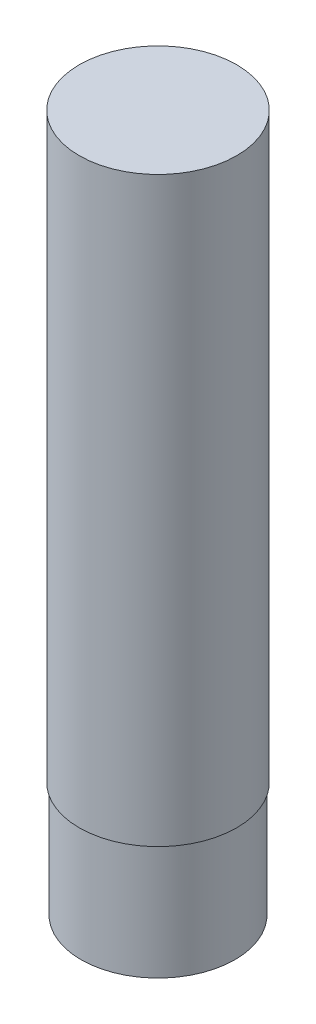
ISO-10303-21;
HEADER;
FILE_DESCRIPTION(('STEP AP214'),'2;1');
FILE_NAME('part.step','',(''),(''),'','','');
FILE_SCHEMA(('AUTOMOTIVE_DESIGN { 1 0 10303 214 1 1 1 1 }'));
ENDSEC;
DATA;
#1=APPLICATION_CONTEXT('core data for automotive mechanical design processes');
#2=APPLICATION_PROTOCOL_DEFINITION('international standard','automotive_design',2000,#1);
#3=PRODUCT_CONTEXT('',#1,'mechanical');
#4=PRODUCT('Part','Part','',(#3));
#5=PRODUCT_RELATED_PRODUCT_CATEGORY('part','',(#4));
#6=PRODUCT_DEFINITION_FORMATION('','',#4);
#7=PRODUCT_DEFINITION_CONTEXT('part definition',#1,'design');
#8=PRODUCT_DEFINITION('design','',#6,#7);
#9=PRODUCT_DEFINITION_SHAPE('','',#8);
#10=(LENGTH_UNIT() NAMED_UNIT(*) SI_UNIT(.MILLI.,.METRE.));
#11=(NAMED_UNIT(*) PLANE_ANGLE_UNIT() SI_UNIT($,.RADIAN.));
#12=(NAMED_UNIT(*) SI_UNIT($,.STERADIAN.) SOLID_ANGLE_UNIT());
#13=UNCERTAINTY_MEASURE_WITH_UNIT(LENGTH_MEASURE(1.E-05),#10,'distance_accuracy_value','');
#14=(GEOMETRIC_REPRESENTATION_CONTEXT(3) GLOBAL_UNCERTAINTY_ASSIGNED_CONTEXT((#13)) GLOBAL_UNIT_ASSIGNED_CONTEXT((#10,
#11,#12)) REPRESENTATION_CONTEXT('',''));
#15=CARTESIAN_POINT('',(0.,0.,0.));
#16=DIRECTION('',(0.,0.,1.));
#17=DIRECTION('',(1.,0.,0.));
#18=AXIS2_PLACEMENT_3D('',#15,#16,#17);
#19=CARTESIAN_POINT('',(0.,215.9,0.));
#20=DIRECTION('',(0.,-1.,0.));
#21=DIRECTION('',(0.,0.,-1.));
#22=AXIS2_PLACEMENT_3D('',#19,#20,#21);
#23=CYLINDRICAL_SURFACE('',#22,29.21);
#24=CARTESIAN_POINT('',(0.,215.9,0.));
#25=DIRECTION('',(0.,1.,0.));
#26=DIRECTION('',(0.,0.,1.));
#27=AXIS2_PLACEMENT_3D('',#24,#25,#26);
#28=CIRCLE('',#27,29.21);
#29=CARTESIAN_POINT('',(0.,215.9,29.21));
#30=VERTEX_POINT('',#29);
#31=EDGE_CURVE('E38',#30,#30,#28,.T.);
#32=ORIENTED_EDGE('',*,*,#31,.F.);
#33=EDGE_LOOP('',(#32));
#34=FACE_BOUND('',#33,.T.);
#35=CARTESIAN_POINT('',(0.,0.,0.));
#36=DIRECTION('',(0.,1.,0.));
#37=DIRECTION('',(0.,0.,1.));
#38=AXIS2_PLACEMENT_3D('',#35,#36,#37);
#39=CIRCLE('',#38,29.21);
#40=CARTESIAN_POINT('',(0.,0.,29.21));
#41=VERTEX_POINT('',#40);
#42=EDGE_CURVE('E42',#41,#41,#39,.T.);
#43=ORIENTED_EDGE('',*,*,#42,.T.);
#44=EDGE_LOOP('',(#43));
#45=FACE_BOUND('',#44,.T.);
#46=ADVANCED_FACE('F32',(#34,#45),#23,.T.);
#47=CARTESIAN_POINT('',(0.,215.9,0.));
#48=DIRECTION('',(0.,1.,0.));
#49=DIRECTION('',(0.,0.,1.));
#50=AXIS2_PLACEMENT_3D('',#47,#48,#49);
#51=PLANE('',#50);
#52=ORIENTED_EDGE('',*,*,#31,.T.);
#53=EDGE_LOOP('',(#52));
#54=FACE_BOUND('',#53,.T.);
#55=ADVANCED_FACE('F63',(#54),#51,.T.);
#56=CARTESIAN_POINT('',(0.,0.,0.));
#57=DIRECTION('',(0.,1.,0.));
#58=DIRECTION('',(0.,0.,1.));
#59=AXIS2_PLACEMENT_3D('',#56,#57,#58);
#60=PLANE('',#59);
#61=CARTESIAN_POINT('',(0.,0.,0.));
#62=DIRECTION('',(0.,1.,0.));
#63=DIRECTION('',(0.,0.,1.));
#64=AXIS2_PLACEMENT_3D('',#61,#62,#63);
#65=CIRCLE('',#64,28.575);
#66=CARTESIAN_POINT('',(0.,0.,28.575));
#67=VERTEX_POINT('',#66);
#68=EDGE_CURVE('E10',#67,#67,#65,.F.);
#69=ORIENTED_EDGE('',*,*,#68,.F.);
#70=EDGE_LOOP('',(#69));
#71=FACE_BOUND('',#70,.T.);
#72=ORIENTED_EDGE('',*,*,#42,.F.);
#73=EDGE_LOOP('',(#72));
#74=FACE_BOUND('',#73,.T.);
#75=ADVANCED_FACE('F56',(#71,#74),#60,.F.);
#76=CARTESIAN_POINT('',(0.,-42.672,0.));
#77=DIRECTION('',(0.,1.,0.));
#78=DIRECTION('',(0.,0.,1.));
#79=AXIS2_PLACEMENT_3D('',#76,#77,#78);
#80=CYLINDRICAL_SURFACE('',#79,28.575);
#81=CARTESIAN_POINT('',(0.,-42.672,0.));
#82=DIRECTION('',(0.,-1.,0.));
#83=DIRECTION('',(0.,0.,-1.));
#84=AXIS2_PLACEMENT_3D('',#81,#82,#83);
#85=CIRCLE('',#84,28.575);
#86=CARTESIAN_POINT('',(0.,-42.672,-28.575));
#87=VERTEX_POINT('',#86);
#88=EDGE_CURVE('E47',#87,#87,#85,.T.);
#89=ORIENTED_EDGE('',*,*,#88,.F.);
#90=EDGE_LOOP('',(#89));
#91=FACE_BOUND('',#90,.T.);
#92=ORIENTED_EDGE('',*,*,#68,.T.);
#93=EDGE_LOOP('',(#92));
#94=FACE_BOUND('',#93,.T.);
#95=ADVANCED_FACE('F54',(#91,#94),#80,.T.);
#96=CARTESIAN_POINT('',(0.,-42.672,0.));
#97=DIRECTION('',(0.,-1.,0.));
#98=DIRECTION('',(0.,0.,-1.));
#99=AXIS2_PLACEMENT_3D('',#96,#97,#98);
#100=PLANE('',#99);
#101=ORIENTED_EDGE('',*,*,#88,.T.);
#102=EDGE_LOOP('',(#101));
#103=FACE_BOUND('',#102,.T.);
#104=ADVANCED_FACE('F52',(#103),#100,.T.);
#105=CLOSED_SHELL('',(#46,#55,#75,#95,#104));
#106=MANIFOLD_SOLID_BREP('B2',#105);
#107=ADVANCED_BREP_SHAPE_REPRESENTATION('',(#18,#106),#14);
#108=SHAPE_DEFINITION_REPRESENTATION(#9,#107);
ENDSEC;
END-ISO-10303-21;
